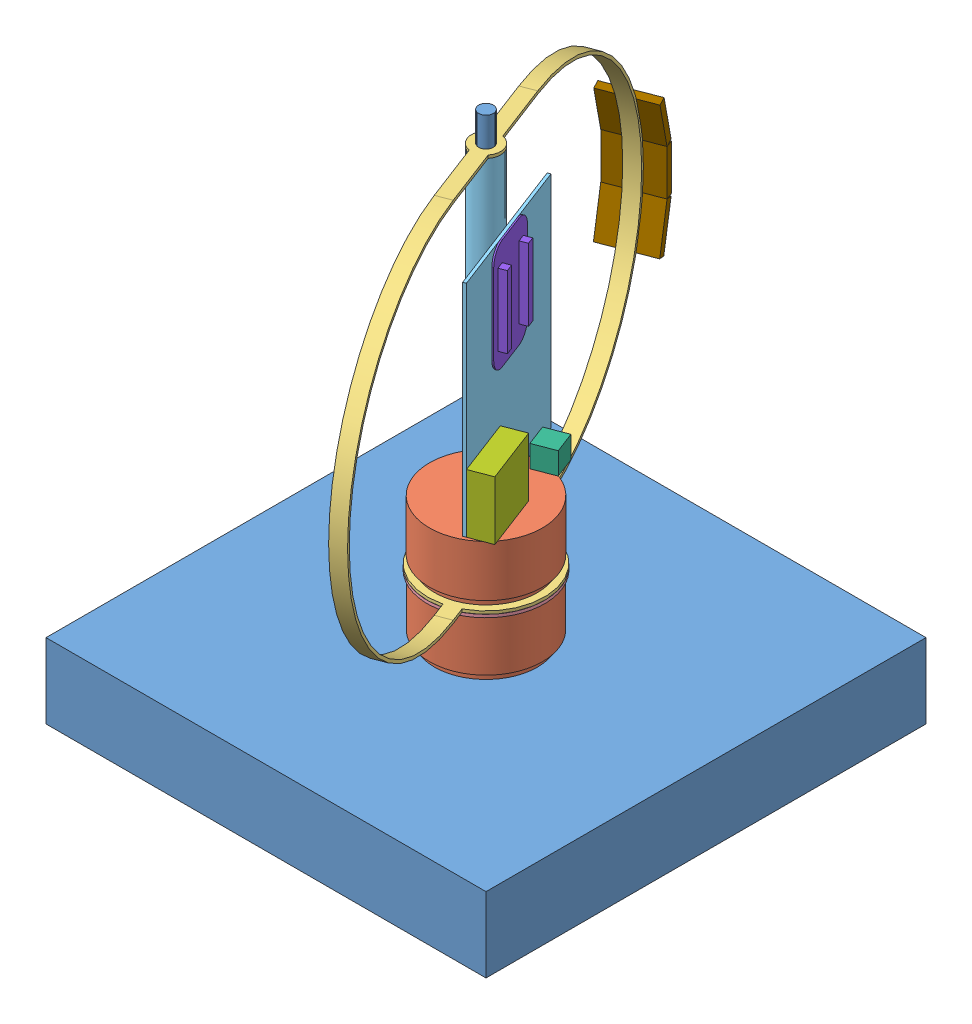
SolidWorks assembly Baugruppe1.sldasm, configuration Standard (file format 7000). Lengths in mm.
Overall size (300 363 355.46).
12 component instances, 9 part files, 29 mates.
Components (placement in the parent):
- foot-1: foot.SLDPRT [Standard] at (24.3037 199.8646 292.6665) size (300 363 300)
- Brushless-motor-1: Brushless-motor.SLDPRT [Standard] at (24.3037 250.8646 292.6665) size (77 40 77)
- Brushless-motor-2: Brushless-motor.SLDPRT [Standard] at (24.3037 294.8646 292.6665) x (-0.092634 0 -0.9957) z (0.9957 0 -0.092634) size (77 40 77)
- rotor-1: rotor.SLDPRT [Standard] at (40.3875 292.8646 334.6686) x (-0.357607 0 -0.933872) z (0.933872 0 -0.357607) size (350 250 80)
- Platte_motor_rotor-1: Platte_motor_rotor.SLDPRT [Standard] at (24.3037 290.8646 292.6665) size (80 2 80)
- Tube_inside_rotor-1: Tube_inside_rotor.SLDPRT [Standard] at (24.3037 340.8646 292.6665) x (-0.357607 0 -0.933872) z (0.933872 0 -0.357607) size (100 200 22)
- IR_Receiver-1: IR_Receiver.SLDPRT [Standard] at (21.2059 352.8646 251.0203) x (0.933872 0 -0.357607) z (0 -1 0) size (15 15 15)
- ubec-1: ubec.SLDPRT [Standard] at (53.3905 385.8646 335.0688) x (-0.357607 0 -0.933872) z (0 -1 0) size (40 15 40)
- beagle_bone_black-1: beagle_bone_black.SLDPRT [Standard] at (35.5102 458.3646 288.3752) x (0 1 0) z (-0.357607 0 -0.933872) size (75 6 40)
- oled-1: oled.SLDPRT [Standard] at (-21.9348 401.8646 122.9808) x (-0.933872 0 0.357607) z (-0.357607 0 -0.933872) size (35 31 5)
- oled-2: oled.SLDPRT [Standard] at (-56.3426 434.2077 130.9993) x (0.933872 0 -0.357607) z (0.344464 -0.268622 0.899548) size (35 31 5)
- oled-3: oled.SLDPRT [Standard] at (-53.2338 370.7042 139.1179) x (0.933872 0 -0.357607) z (0.343312 0.279915 0.89654) size (35 31 5)
Mates (geometry in assembly coordinates):
- Konzentrisch1: concentric anti-aligned: cylinder of foot-1 through (24.3037 562.8646 292.6665) axis (0 -1 0) radius 5; cylinder of Brushless-motor-1 through (24.3037 250.8646 292.6665) axis (0 1 0) radius 5
- Deckungsgleich1: coincident anti-aligned: plane of foot-1 through (24.3037 250.8646 292.6665) normal (0 1 0); plane of Brushless-motor-1 through (24.3037 250.8646 292.6665) normal (0 -1 0)
- Konzentrisch2: concentric anti-aligned: cylinder of foot-1 through (24.3037 562.8646 292.6665) axis (0 -1 0) radius 5; cylinder of Brushless-motor-2 through (24.3037 294.8646 292.6665) axis (0 1 0) radius 5
- Deckungsgleich9: coincident anti-aligned: cylinder of foot-1 through (24.3037 562.8646 292.6665) axis (0 -1 0) radius 5; circle of Platte_motor_rotor-1
- Deckungsgleich10: coincident anti-aligned: plane of Brushless-motor-1 through (24.3037 290.8646 292.6665) normal (0 1 0); plane of Platte_motor_rotor-1 through (24.3037 290.8646 292.6665) normal (0 -1 0)
- Konzentrisch4: concentric anti-aligned: cylinder of foot-1 through (24.3037 562.8646 292.6665) axis (0 -1 0) radius 5; cylinder of rotor-1 through (24.3037 292.8646 292.6665) axis (0 1 0) radius 5
- Deckungsgleich11: coincident anti-aligned: plane of rotor-1 through (35.7182 292.8646 336.4566) normal (0 -1 0); plane of Platte_motor_rotor-1 through (24.3037 292.8646 292.6665) normal (0 1 0)
- Deckungsgleich12: coincident anti-aligned: plane of Brushless-motor-2 through (24.3037 294.8646 292.6665) normal (0 -1 0); plane of rotor-1 through (35.7182 294.8646 336.4566) normal (0 1 0)
- Deckungsgleich13: coincident anti-aligned: cylinder of foot-1 through (24.3037 562.8646 292.6665) axis (0 -1 0) radius 5; circle of Tube_inside_rotor-1
- Deckungsgleich14: coincident anti-aligned: plane of rotor-1 through (35.7182 540.8646 336.4566) normal (0 -1 0); plane of Tube_inside_rotor-1 through (24.3037 540.8646 292.6665) normal (0 1 0)
- Parallel2: parallel: line of rotor-1 through (25.8761 542.8646 282.7909) axis (-0.357607 0 -0.933872); plane of Tube_inside_rotor-1 through (33.6424 340.8646 289.0904) normal (-0.933872 0 0.357607)
- Deckungsgleich19: coincident anti-aligned: plane of Tube_inside_rotor-1 through (35.5102 340.8646 288.3752) normal (0.933872 0 -0.357607); plane of ubec-1 through (53.3905 345.8646 335.0688) normal (-0.933872 0 0.357607)
- Deckungsgleich20: coincident: line of Tube_inside_rotor-1 through (53.3905 495.8646 335.0688) axis (0 -1 0); plane of ubec-1 through (53.3905 345.8646 335.0688) normal (0.357607 0 0.933872)
- Deckungsgleich21: coincident: line of Tube_inside_rotor-1 through (53.3905 345.8646 335.0688) axis (-0.357607 0 -0.933872); plane of ubec-1 through (53.3905 345.8646 335.0688) normal (0 -1 0)
- Deckungsgleich22: coincident anti-aligned: plane of Tube_inside_rotor-1 through (35.5102 340.8646 288.3752) normal (0.933872 0 -0.357607); plane of IR_Receiver-1 through (21.2059 337.8646 251.0203) normal (-0.933872 0 0.357607)
- Abstand8: distance = 10 mm: line of Tube_inside_rotor-1 through (17.6298 345.8646 241.6816) axis (0 1 0); plane of IR_Receiver-1 through (21.2059 337.8646 251.0203) normal (-0.357607 0 -0.933872)
- Abstand7: distance = 8 mm: plane of IR_Receiver-1 through (21.2059 337.8646 251.0203) normal (0 -1 0); line of Tube_inside_rotor-1 through (53.3905 345.8646 335.0688) axis (-0.357607 0 -0.933872)
- Deckungsgleich26: coincident anti-aligned: plane of Tube_inside_rotor-1 through (35.5102 340.8646 288.3752) normal (0.933872 0 -0.357607); plane of beagle_bone_black-1 through (35.5102 458.3646 288.3752) normal (-0.933872 0 0.357607)
- Deckungsgleich29: coincident aligned: plane of Tube_inside_rotor-1 through (53.3905 495.8646 335.0688) normal (0 1 0); plane of beagle_bone_black-1 through (29.2919 495.8646 269.3402) normal (0 1 0)
- Abstand9: distance = 30 mm aligned: plane of beagle_bone_black-1 through (43.5962 420.8646 306.6951) normal (0.357607 0 0.933872); plane of Tube_inside_rotor-1 through (53.3905 345.8646 335.0688) normal (0.357607 0 0.933872)
- Abstand12: distance = 125 mm anti-aligned: plane of Tube_inside_rotor-1 through (17.6298 345.8646 241.6816) normal (-0.357607 0 -0.933872); plane of oled-1 through (-21.9348 401.8646 122.9808) normal (0.357607 0 0.933872)
- Abstand13: distance = 12.5 mm aligned: plane of rotor-1 through (45.0569 292.8646 332.8805) normal (0.933872 0 -0.357607); plane of oled-1 through (-23.7228 401.8646 118.3114) normal (0.933872 0 -0.357607)
- Abstand14: distance = 110 mm aligned: plane of rotor-1 through (35.7182 542.8646 336.4566) normal (0 1 0); plane of oled-1 through (-23.7228 432.8646 118.3114) normal (0 1 0)
- Deckungsgleich35: coincident aligned: line of oled-1 through (-54.6203 432.8646 135.497) axis (0.933872 0 -0.357607); line of oled-2 through (-54.6203 432.8646 135.497) axis (0.933872 0 -0.357607)
- Deckungsgleich36: coincident aligned: plane of oled-1 through (-23.7228 401.8646 118.3114) normal (0.933872 0 -0.357607); plane of oled-2 through (-21.9348 432.8646 122.9808) normal (0.933872 0 -0.357607)
- Deckungsgleich37: coincident: cylinder of rotor-1 through (11.0927 417.8646 244.1849) axis (-0.933872 0 0.357607) radius 125; line of oled-2 through (-18.9569 462.7252 130.7574) axis (-0.933872 0 0.357607)
- Deckungsgleich38: coincident aligned: line of oled-1 through (-21.9348 401.8646 122.9808) axis (-0.933872 0 0.357607); line of oled-3 through (-21.9348 401.8646 122.9808) axis (-0.933872 0 0.357607)
- Deckungsgleich39: coincident aligned: plane of oled-1 through (-23.7228 401.8646 118.3114) normal (0.933872 0 -0.357607); plane of oled-3 through (-18.8317 372.1038 131.0843) normal (0.933872 0 -0.357607)
- Deckungsgleich40: coincident: cylinder of rotor-1 through (11.0927 417.8646 244.1849) axis (-0.933872 0 0.357607) radius 125; line of oled-3 through (-51.5172 372.1038 143.6006) axis (0.933872 0 -0.357607)
